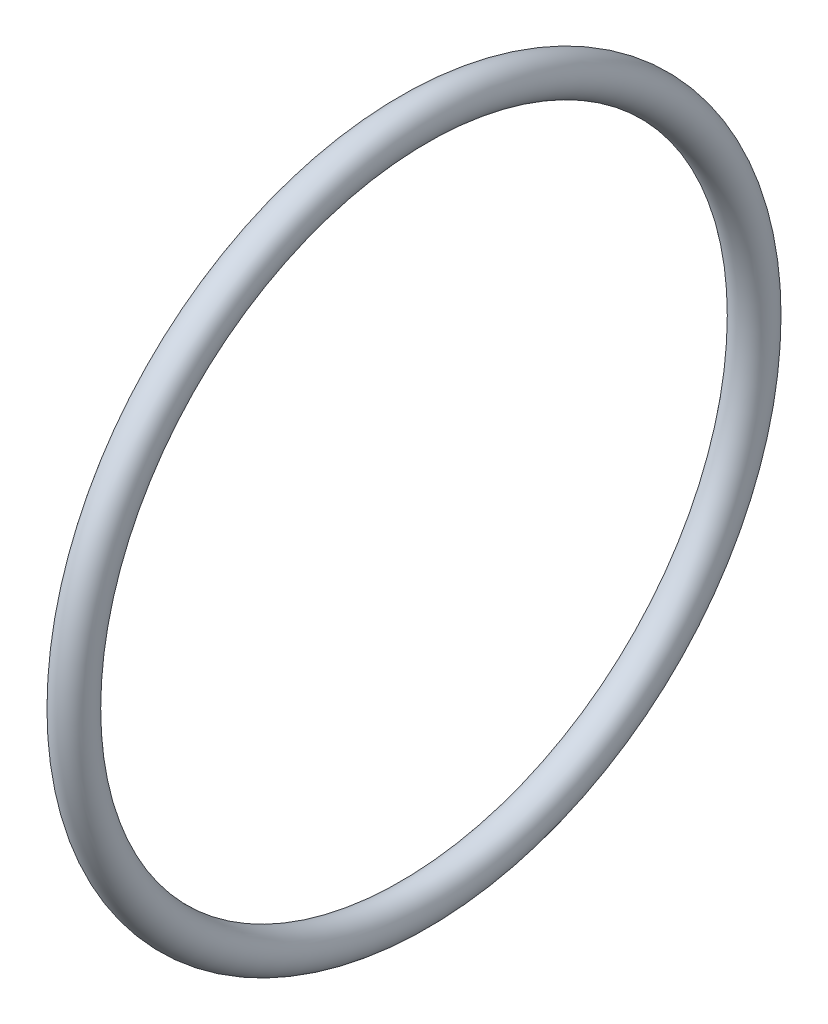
ISO-10303-21;
HEADER;
FILE_DESCRIPTION(('STEP AP214'),'2;1');
FILE_NAME('part.step','',(''),(''),'','','');
FILE_SCHEMA(('AUTOMOTIVE_DESIGN { 1 0 10303 214 1 1 1 1 }'));
ENDSEC;
DATA;
#1=APPLICATION_CONTEXT('core data for automotive mechanical design processes');
#2=APPLICATION_PROTOCOL_DEFINITION('international standard','automotive_design',2000,#1);
#3=PRODUCT_CONTEXT('',#1,'mechanical');
#4=PRODUCT('Part','Part','',(#3));
#5=PRODUCT_RELATED_PRODUCT_CATEGORY('part','',(#4));
#6=PRODUCT_DEFINITION_FORMATION('','',#4);
#7=PRODUCT_DEFINITION_CONTEXT('part definition',#1,'design');
#8=PRODUCT_DEFINITION('design','',#6,#7);
#9=PRODUCT_DEFINITION_SHAPE('','',#8);
#10=(LENGTH_UNIT() NAMED_UNIT(*) SI_UNIT(.MILLI.,.METRE.));
#11=(NAMED_UNIT(*) PLANE_ANGLE_UNIT() SI_UNIT($,.RADIAN.));
#12=(NAMED_UNIT(*) SI_UNIT($,.STERADIAN.) SOLID_ANGLE_UNIT());
#13=UNCERTAINTY_MEASURE_WITH_UNIT(LENGTH_MEASURE(1.E-05),#10,'distance_accuracy_value','');
#14=(GEOMETRIC_REPRESENTATION_CONTEXT(3) GLOBAL_UNCERTAINTY_ASSIGNED_CONTEXT((#13)) GLOBAL_UNIT_ASSIGNED_CONTEXT((#10,
#11,#12)) REPRESENTATION_CONTEXT('',''));
#15=CARTESIAN_POINT('',(0.,0.,0.));
#16=DIRECTION('',(0.,0.,1.));
#17=DIRECTION('',(1.,0.,0.));
#18=AXIS2_PLACEMENT_3D('',#15,#16,#17);
#19=CARTESIAN_POINT('',(2.49298983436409,0.,0.));
#20=DIRECTION('',(-1.,0.,0.));
#21=DIRECTION('',(0.,0.,1.));
#22=AXIS2_PLACEMENT_3D('',#19,#20,#21);
#23=TOROIDAL_SURFACE('',#22,19.6818180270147,1.1);
#24=CARTESIAN_POINT('',(2.49298983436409,0.,20.7818180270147));
#25=VERTEX_POINT('',#24);
#26=VERTEX_LOOP('',#25);
#27=FACE_BOUND('',#26,.T.);
#28=ADVANCED_FACE('F32',(#27),#23,.T.);
#29=CLOSED_SHELL('',(#28));
#30=CARTESIAN_POINT('',(2.49298983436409,0.,0.));
#31=DIRECTION('',(-1.,0.,0.));
#32=DIRECTION('',(0.,0.,1.));
#33=AXIS2_PLACEMENT_3D('',#30,#31,#32);
#34=TOROIDAL_SURFACE('',#33,19.6818180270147,0.732622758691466);
#35=CARTESIAN_POINT('',(2.49298983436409,0.,20.4144407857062));
#36=VERTEX_POINT('',#35);
#37=VERTEX_LOOP('',#36);
#38=FACE_BOUND('',#37,.T.);
#39=ADVANCED_FACE('F44',(#38),#34,.F.);
#40=CLOSED_SHELL('',(#39));
#41=ORIENTED_CLOSED_SHELL('',*,#40,.T.);
#42=BREP_WITH_VOIDS('B2',#29,(#41));
#43=ADVANCED_BREP_SHAPE_REPRESENTATION('',(#18,#42),#14);
#44=SHAPE_DEFINITION_REPRESENTATION(#9,#43);
ENDSEC;
END-ISO-10303-21;
